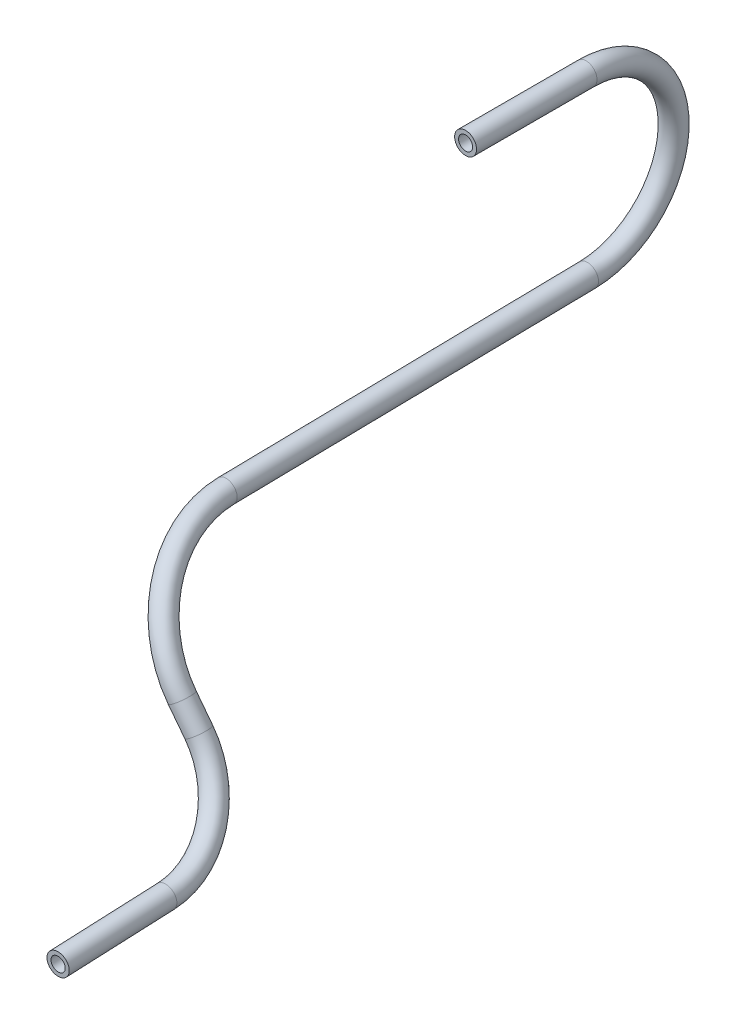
ISO-10303-21;
HEADER;
FILE_DESCRIPTION(('STEP AP214'),'2;1');
FILE_NAME('part.step','',(''),(''),'','','');
FILE_SCHEMA(('AUTOMOTIVE_DESIGN { 1 0 10303 214 1 1 1 1 }'));
ENDSEC;
DATA;
#1=APPLICATION_CONTEXT('core data for automotive mechanical design processes');
#2=APPLICATION_PROTOCOL_DEFINITION('international standard','automotive_design',2000,#1);
#3=PRODUCT_CONTEXT('',#1,'mechanical');
#4=PRODUCT('Part','Part','',(#3));
#5=PRODUCT_RELATED_PRODUCT_CATEGORY('part','',(#4));
#6=PRODUCT_DEFINITION_FORMATION('','',#4);
#7=PRODUCT_DEFINITION_CONTEXT('part definition',#1,'design');
#8=PRODUCT_DEFINITION('design','',#6,#7);
#9=PRODUCT_DEFINITION_SHAPE('','',#8);
#10=(LENGTH_UNIT() NAMED_UNIT(*) SI_UNIT(.MILLI.,.METRE.));
#11=(NAMED_UNIT(*) PLANE_ANGLE_UNIT() SI_UNIT($,.RADIAN.));
#12=(NAMED_UNIT(*) SI_UNIT($,.STERADIAN.) SOLID_ANGLE_UNIT());
#13=UNCERTAINTY_MEASURE_WITH_UNIT(LENGTH_MEASURE(1.E-05),#10,'distance_accuracy_value','');
#14=(GEOMETRIC_REPRESENTATION_CONTEXT(3) GLOBAL_UNCERTAINTY_ASSIGNED_CONTEXT((#13)) GLOBAL_UNIT_ASSIGNED_CONTEXT((#10,
#11,#12)) REPRESENTATION_CONTEXT('',''));
#15=CARTESIAN_POINT('',(0.,0.,0.));
#16=DIRECTION('',(0.,0.,1.));
#17=DIRECTION('',(1.,0.,0.));
#18=AXIS2_PLACEMENT_3D('',#15,#16,#17);
#19=CARTESIAN_POINT('',(0.,-25.3980657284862,-17.6841455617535));
#20=DIRECTION('',(0.,-0.0174524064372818,0.999847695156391));
#21=DIRECTION('',(0.,-0.999847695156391,-0.0174524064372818));
#22=AXIS2_PLACEMENT_3D('',#19,#20,#21);
#23=CYLINDRICAL_SURFACE('',#22,1.5875);
#24=CARTESIAN_POINT('',(0.,-25.3980657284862,-17.6841455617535));
#25=DIRECTION('',(0.,0.0174524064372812,-0.999847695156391));
#26=DIRECTION('',(1.,0.,0.));
#27=AXIS2_PLACEMENT_3D('',#24,#25,#26);
#28=CIRCLE('',#27,1.5875);
#29=CARTESIAN_POINT('',(0.,-26.985323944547,-17.7118512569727));
#30=VERTEX_POINT('',#29);
#31=EDGE_CURVE('E42',#30,#30,#28,.T.);
#32=ORIENTED_EDGE('',*,*,#31,.F.);
#33=EDGE_LOOP('',(#32));
#34=FACE_BOUND('',#33,.T.);
#35=CARTESIAN_POINT('',(0.,-26.3123536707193,34.6953755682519));
#36=DIRECTION('',(0.,0.0174524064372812,-0.999847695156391));
#37=DIRECTION('',(1.,0.,0.));
#38=AXIS2_PLACEMENT_3D('',#35,#36,#37);
#39=CIRCLE('',#38,1.5875);
#40=CARTESIAN_POINT('',(-0.91055259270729,-25.0121478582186,34.7180707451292));
#41=VERTEX_POINT('',#40);
#42=EDGE_CURVE('E10',#41,#41,#39,.T.);
#43=ORIENTED_EDGE('',*,*,#42,.T.);
#44=EDGE_LOOP('',(#43));
#45=FACE_BOUND('',#44,.T.);
#46=ADVANCED_FACE('F32',(#34,#45),#23,.T.);
#47=CARTESIAN_POINT('',(0.,-25.3980657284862,-17.6841455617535));
#48=DIRECTION('',(0.,-0.0174524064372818,0.999847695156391));
#49=DIRECTION('',(0.,-0.999847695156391,-0.0174524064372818));
#50=AXIS2_PLACEMENT_3D('',#47,#48,#49);
#51=CYLINDRICAL_SURFACE('',#50,1.016);
#52=CARTESIAN_POINT('',(0.,-25.3980657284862,-17.6841455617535));
#53=DIRECTION('',(0.,0.0174524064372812,-0.999847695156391));
#54=DIRECTION('',(1.,0.,0.));
#55=AXIS2_PLACEMENT_3D('',#52,#53,#54);
#56=CIRCLE('',#55,1.016);
#57=CARTESIAN_POINT('',(0.,-26.4139109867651,-17.7018772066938));
#58=VERTEX_POINT('',#57);
#59=EDGE_CURVE('E46',#58,#58,#56,.T.);
#60=ORIENTED_EDGE('',*,*,#59,.T.);
#61=EDGE_LOOP('',(#60));
#62=FACE_BOUND('',#61,.T.);
#63=CARTESIAN_POINT('',(0.,-26.3123536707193,34.6953755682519));
#64=DIRECTION('',(0.,0.0174524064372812,-0.999847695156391));
#65=DIRECTION('',(1.,0.,0.));
#66=AXIS2_PLACEMENT_3D('',#63,#64,#65);
#67=CIRCLE('',#66,1.016);
#68=CARTESIAN_POINT('',(-0.582753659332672,-25.4802219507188,34.7099004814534));
#69=VERTEX_POINT('',#68);
#70=EDGE_CURVE('E38',#69,#69,#67,.T.);
#71=ORIENTED_EDGE('',*,*,#70,.F.);
#72=EDGE_LOOP('',(#71));
#73=FACE_BOUND('',#72,.T.);
#74=ADVANCED_FACE('F108',(#62,#73),#51,.F.);
#75=CARTESIAN_POINT('',(0.,-12.7,-17.4625));
#76=DIRECTION('',(-1.,0.,0.));
#77=DIRECTION('',(0.,0.,1.));
#78=AXIS2_PLACEMENT_3D('',#75,#76,#77);
#79=TOROIDAL_SURFACE('',#78,12.7,1.5875);
#80=CARTESIAN_POINT('',(0.,0.,-17.4625));
#81=DIRECTION('',(0.,0.,1.));
#82=DIRECTION('',(1.,0.,0.));
#83=AXIS2_PLACEMENT_3D('',#80,#81,#82);
#84=CIRCLE('',#83,1.5875);
#85=CARTESIAN_POINT('',(0.,1.5875,-17.4625));
#86=VERTEX_POINT('',#85);
#87=EDGE_CURVE('E51',#86,#86,#84,.T.);
#88=CARTESIAN_POINT('',(0.,-12.7,-17.4625));
#89=DIRECTION('',(-1.,0.,0.));
#90=DIRECTION('',(0.,0.,1.));
#91=AXIS2_PLACEMENT_3D('',#88,#89,#90);
#92=CIRCLE('',#91,14.2875);
#93=EDGE_CURVE('',#86,#30,#92,.T.);
#94=ORIENTED_EDGE('',*,*,#87,.F.);
#95=ORIENTED_EDGE('',*,*,#31,.T.);
#96=ORIENTED_EDGE('',*,*,#93,.T.);
#97=ORIENTED_EDGE('',*,*,#93,.F.);
#98=EDGE_LOOP('',(#94,#96,#95,#97));
#99=FACE_BOUND('',#98,.T.);
#100=ADVANCED_FACE('F113',(#99),#79,.T.);
#101=CARTESIAN_POINT('',(0.,-12.7,-17.4625));
#102=DIRECTION('',(-1.,0.,0.));
#103=DIRECTION('',(0.,0.,1.));
#104=AXIS2_PLACEMENT_3D('',#101,#102,#103);
#105=TOROIDAL_SURFACE('',#104,12.7,1.016);
#106=CARTESIAN_POINT('',(0.,0.,-17.4625));
#107=DIRECTION('',(0.,0.,1.));
#108=DIRECTION('',(1.,0.,0.));
#109=AXIS2_PLACEMENT_3D('',#106,#107,#108);
#110=CIRCLE('',#109,1.016);
#111=CARTESIAN_POINT('',(0.,1.016,-17.4625));
#112=VERTEX_POINT('',#111);
#113=EDGE_CURVE('E55',#112,#112,#110,.T.);
#114=CARTESIAN_POINT('',(0.,-12.7,-17.4625));
#115=DIRECTION('',(-1.,0.,0.));
#116=DIRECTION('',(0.,0.,1.));
#117=AXIS2_PLACEMENT_3D('',#114,#115,#116);
#118=CIRCLE('',#117,13.716);
#119=EDGE_CURVE('',#112,#58,#118,.T.);
#120=ORIENTED_EDGE('',*,*,#113,.T.);
#121=ORIENTED_EDGE('',*,*,#59,.F.);
#122=ORIENTED_EDGE('',*,*,#119,.T.);
#123=ORIENTED_EDGE('',*,*,#119,.F.);
#124=EDGE_LOOP('',(#120,#122,#121,#123));
#125=FACE_BOUND('',#124,.T.);
#126=ADVANCED_FACE('F118',(#125),#105,.F.);
#127=CARTESIAN_POINT('',(0.,0.,-17.4625));
#128=DIRECTION('',(0.,0.,1.));
#129=DIRECTION('',(0.,-1.,0.));
#130=AXIS2_PLACEMENT_3D('',#127,#128,#129);
#131=CYLINDRICAL_SURFACE('',#130,1.016);
#132=ORIENTED_EDGE('',*,*,#113,.F.);
#133=EDGE_LOOP('',(#132));
#134=FACE_BOUND('',#133,.T.);
#135=CARTESIAN_POINT('',(0.,0.,0.));
#136=DIRECTION('',(0.,0.,1.));
#137=DIRECTION('',(1.,0.,0.));
#138=AXIS2_PLACEMENT_3D('',#135,#136,#137);
#139=CIRCLE('',#138,1.016);
#140=CARTESIAN_POINT('',(1.016,0.,0.));
#141=VERTEX_POINT('',#140);
#142=EDGE_CURVE('E56',#141,#141,#139,.T.);
#143=ORIENTED_EDGE('',*,*,#142,.T.);
#144=EDGE_LOOP('',(#143));
#145=FACE_BOUND('',#144,.T.);
#146=ADVANCED_FACE('F124',(#134,#145),#131,.F.);
#147=CARTESIAN_POINT('',(0.,0.,-17.4625));
#148=DIRECTION('',(0.,0.,1.));
#149=DIRECTION('',(0.,-1.,0.));
#150=AXIS2_PLACEMENT_3D('',#147,#148,#149);
#151=CYLINDRICAL_SURFACE('',#150,1.5875);
#152=ORIENTED_EDGE('',*,*,#87,.T.);
#153=EDGE_LOOP('',(#152));
#154=FACE_BOUND('',#153,.T.);
#155=CARTESIAN_POINT('',(0.,0.,0.));
#156=DIRECTION('',(0.,0.,1.));
#157=DIRECTION('',(1.,0.,0.));
#158=AXIS2_PLACEMENT_3D('',#155,#156,#157);
#159=CIRCLE('',#158,1.5875);
#160=CARTESIAN_POINT('',(1.5875,0.,0.));
#161=VERTEX_POINT('',#160);
#162=EDGE_CURVE('E52',#161,#161,#159,.T.);
#163=ORIENTED_EDGE('',*,*,#162,.F.);
#164=EDGE_LOOP('',(#163));
#165=FACE_BOUND('',#164,.T.);
#166=ADVANCED_FACE('F131',(#154,#165),#151,.T.);
#167=CARTESIAN_POINT('',(0.,0.,0.));
#168=DIRECTION('',(0.,0.,1.));
#169=DIRECTION('',(1.,0.,0.));
#170=AXIS2_PLACEMENT_3D('',#167,#168,#169);
#171=PLANE('',#170);
#172=ORIENTED_EDGE('',*,*,#142,.F.);
#173=EDGE_LOOP('',(#172));
#174=FACE_BOUND('',#173,.T.);
#175=ORIENTED_EDGE('',*,*,#162,.T.);
#176=EDGE_LOOP('',(#175));
#177=FACE_BOUND('',#176,.T.);
#178=ADVANCED_FACE('F135',(#174,#177),#171,.T.);
#179=CARTESIAN_POINT('',(9.10552592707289,-39.3144117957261,34.4684237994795));
#180=DIRECTION('',(-0.819152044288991,-0.573489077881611,-0.0100102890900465));
#181=DIRECTION('',(0.573517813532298,-0.819193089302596,0.));
#182=AXIS2_PLACEMENT_3D('',#179,#180,#181);
#183=TOROIDAL_SURFACE('',#182,15.875,1.01600000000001);
#184=CARTESIAN_POINT('',(9.26443926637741,-39.818343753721,50.3346276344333));
#185=DIRECTION('',(0.573489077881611,-0.818597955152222,-0.0317437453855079));
#186=DIRECTION('',(-0.478046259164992,-0.302936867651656,-0.824439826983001));
#187=AXIS2_PLACEMENT_3D('',#184,#185,#186);
#188=CIRCLE('',#187,1.01600000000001);
#189=CARTESIAN_POINT('',(9.2746097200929,-39.8505953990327,51.3500646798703));
#190=VERTEX_POINT('',#189);
#191=EDGE_CURVE('E66',#190,#190,#188,.T.);
#192=CARTESIAN_POINT('',(9.10552592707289,-39.3144117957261,34.4684237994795));
#193=DIRECTION('',(-0.819152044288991,-0.573489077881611,-0.0100102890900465));
#194=DIRECTION('',(0.573517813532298,-0.819193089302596,0.));
#195=AXIS2_PLACEMENT_3D('',#192,#193,#194);
#196=CIRCLE('',#195,16.891);
#197=EDGE_CURVE('',#190,#69,#196,.T.);
#198=ORIENTED_EDGE('',*,*,#191,.T.);
#199=ORIENTED_EDGE('',*,*,#70,.T.);
#200=ORIENTED_EDGE('',*,*,#197,.T.);
#201=ORIENTED_EDGE('',*,*,#197,.F.);
#202=EDGE_LOOP('',(#198,#200,#199,#201));
#203=FACE_BOUND('',#202,.T.);
#204=ADVANCED_FACE('F139',(#203),#183,.F.);
#205=CARTESIAN_POINT('',(9.10552592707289,-39.3144117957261,34.4684237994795));
#206=DIRECTION('',(-0.819152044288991,-0.573489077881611,-0.0100102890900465));
#207=DIRECTION('',(0.573517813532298,-0.819193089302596,0.));
#208=AXIS2_PLACEMENT_3D('',#205,#206,#207);
#209=TOROIDAL_SURFACE('',#208,15.875,1.5875);
#210=CARTESIAN_POINT('',(9.26443926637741,-39.818343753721,50.3346276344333));
#211=DIRECTION('',(0.573489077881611,-0.818597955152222,-0.0317437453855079));
#212=DIRECTION('',(-0.478046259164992,-0.302936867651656,-0.824439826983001));
#213=AXIS2_PLACEMENT_3D('',#210,#211,#212);
#214=CIRCLE('',#213,1.5875);
#215=CARTESIAN_POINT('',(9.28033060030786,-39.8687369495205,51.9212480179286));
#216=VERTEX_POINT('',#215);
#217=EDGE_CURVE('E59',#216,#216,#214,.T.);
#218=CARTESIAN_POINT('',(9.10552592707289,-39.3144117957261,34.4684237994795));
#219=DIRECTION('',(-0.819152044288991,-0.573489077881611,-0.0100102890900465));
#220=DIRECTION('',(0.573517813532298,-0.819193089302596,0.));
#221=AXIS2_PLACEMENT_3D('',#218,#219,#220);
#222=CIRCLE('',#221,17.4625);
#223=EDGE_CURVE('',#216,#41,#222,.T.);
#224=ORIENTED_EDGE('',*,*,#217,.F.);
#225=ORIENTED_EDGE('',*,*,#42,.F.);
#226=ORIENTED_EDGE('',*,*,#223,.T.);
#227=ORIENTED_EDGE('',*,*,#223,.F.);
#228=EDGE_LOOP('',(#224,#226,#225,#227));
#229=FACE_BOUND('',#228,.T.);
#230=ADVANCED_FACE('F141',(#229),#209,.T.);
#231=CARTESIAN_POINT('',(11.5404740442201,-43.0671543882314,50.2086446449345));
#232=DIRECTION('',(-0.573489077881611,0.818597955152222,0.0317437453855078));
#233=DIRECTION('',(-0.819010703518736,-0.57377823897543,0.));
#234=AXIS2_PLACEMENT_3D('',#231,#232,#233);
#235=CYLINDRICAL_SURFACE('',#234,1.58749999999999);
#236=CARTESIAN_POINT('',(11.5404740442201,-43.0671543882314,50.2086446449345));
#237=DIRECTION('',(0.573489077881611,-0.818597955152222,-0.0317437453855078));
#238=DIRECTION('',(0.819010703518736,0.57377823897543,0.));
#239=AXIS2_PLACEMENT_3D('',#236,#237,#238);
#240=CIRCLE('',#239,1.58749999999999);
#241=CARTESIAN_POINT('',(11.5137341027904,-43.0243584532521,48.6219469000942));
#242=VERTEX_POINT('',#241);
#243=EDGE_CURVE('E69',#242,#242,#240,.T.);
#244=ORIENTED_EDGE('',*,*,#243,.F.);
#245=EDGE_LOOP('',(#244));
#246=FACE_BOUND('',#245,.T.);
#247=ORIENTED_EDGE('',*,*,#217,.T.);
#248=EDGE_LOOP('',(#247));
#249=FACE_BOUND('',#248,.T.);
#250=ADVANCED_FACE('F144',(#246,#249),#235,.T.);
#251=CARTESIAN_POINT('',(11.5404740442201,-43.0671543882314,50.2086446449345));
#252=DIRECTION('',(-0.573489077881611,0.818597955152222,0.0317437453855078));
#253=DIRECTION('',(-0.819010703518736,-0.57377823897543,0.));
#254=AXIS2_PLACEMENT_3D('',#251,#252,#253);
#255=CYLINDRICAL_SURFACE('',#254,1.016);
#256=CARTESIAN_POINT('',(11.5404740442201,-43.0671543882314,50.2086446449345));
#257=DIRECTION('',(0.573489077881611,-0.818597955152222,-0.0317437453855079));
#258=DIRECTION('',(0.819010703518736,0.57377823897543,0.));
#259=AXIS2_PLACEMENT_3D('',#256,#257,#258);
#260=CIRCLE('',#259,1.01600000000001);
#261=CARTESIAN_POINT('',(11.5233604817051,-43.0397649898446,49.1931580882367));
#262=VERTEX_POINT('',#261);
#263=EDGE_CURVE('E75',#262,#262,#260,.T.);
#264=ORIENTED_EDGE('',*,*,#263,.T.);
#265=EDGE_LOOP('',(#264));
#266=FACE_BOUND('',#265,.T.);
#267=ORIENTED_EDGE('',*,*,#191,.F.);
#268=EDGE_LOOP('',(#267));
#269=FACE_BOUND('',#268,.T.);
#270=ADVANCED_FACE('F151',(#266,#269),#255,.F.);
#271=CARTESIAN_POINT('',(11.7543935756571,-43.4095218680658,62.9022266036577));
#272=DIRECTION('',(0.819040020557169,0.573733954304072,0.0016716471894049));
#273=DIRECTION('',(-0.573734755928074,0.819041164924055,0.));
#274=AXIS2_PLACEMENT_3D('',#271,#272,#273);
#275=TOROIDAL_SURFACE('',#274,12.7,1.01600000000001);
#276=CARTESIAN_POINT('',(19.0377048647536,-53.8057158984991,62.4990810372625));
#277=DIRECTION('',(0.0168440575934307,-0.0269580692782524,0.999494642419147));
#278=DIRECTION('',(0.,-0.999636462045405,-0.0269618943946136));
#279=AXIS2_PLACEMENT_3D('',#276,#277,#278);
#280=CIRCLE('',#279,1.01600000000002);
#281=CARTESIAN_POINT('',(19.6203697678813,-54.6374114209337,62.4668293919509));
#282=VERTEX_POINT('',#281);
#283=EDGE_CURVE('E82',#282,#282,#280,.T.);
#284=CARTESIAN_POINT('',(11.7543935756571,-43.4095218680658,62.9022266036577));
#285=DIRECTION('',(0.819040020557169,0.573733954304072,0.0016716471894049));
#286=DIRECTION('',(-0.573734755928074,0.819041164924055,0.));
#287=AXIS2_PLACEMENT_3D('',#284,#285,#286);
#288=CIRCLE('',#287,13.716);
#289=EDGE_CURVE('',#282,#262,#288,.T.);
#290=ORIENTED_EDGE('',*,*,#283,.T.);
#291=ORIENTED_EDGE('',*,*,#263,.F.);
#292=ORIENTED_EDGE('',*,*,#289,.T.);
#293=ORIENTED_EDGE('',*,*,#289,.F.);
#294=EDGE_LOOP('',(#290,#292,#291,#293));
#295=FACE_BOUND('',#294,.T.);
#296=ADVANCED_FACE('F103',(#295),#275,.F.);
#297=CARTESIAN_POINT('',(11.7543935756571,-43.4095218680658,62.9022266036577));
#298=DIRECTION('',(0.819040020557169,0.573733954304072,0.0016716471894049));
#299=DIRECTION('',(-0.573734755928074,0.819041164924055,0.));
#300=AXIS2_PLACEMENT_3D('',#297,#298,#299);
#301=TOROIDAL_SURFACE('',#300,12.7,1.58750000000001);
#302=CARTESIAN_POINT('',(19.0377048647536,-53.805715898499,62.4990810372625));
#303=DIRECTION('',(0.0168440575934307,-0.0269580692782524,0.999494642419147));
#304=DIRECTION('',(0.819998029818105,0.572364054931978,0.00161855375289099));
#305=AXIS2_PLACEMENT_3D('',#302,#303,#304);
#306=CIRCLE('',#305,1.58750000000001);
#307=CARTESIAN_POINT('',(19.9481187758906,-55.1052401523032,62.4486878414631));
#308=VERTEX_POINT('',#307);
#309=EDGE_CURVE('E72',#308,#308,#306,.T.);
#310=CARTESIAN_POINT('',(11.7543935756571,-43.4095218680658,62.9022266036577));
#311=DIRECTION('',(0.819040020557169,0.573733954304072,0.0016716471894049));
#312=DIRECTION('',(-0.573734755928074,0.819041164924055,0.));
#313=AXIS2_PLACEMENT_3D('',#310,#311,#312);
#314=CIRCLE('',#313,14.2875);
#315=EDGE_CURVE('',#308,#242,#314,.T.);
#316=ORIENTED_EDGE('',*,*,#309,.F.);
#317=ORIENTED_EDGE('',*,*,#243,.T.);
#318=ORIENTED_EDGE('',*,*,#315,.T.);
#319=ORIENTED_EDGE('',*,*,#315,.F.);
#320=EDGE_LOOP('',(#316,#318,#317,#319));
#321=FACE_BOUND('',#320,.T.);
#322=ADVANCED_FACE('F94',(#321),#301,.T.);
#323=CARTESIAN_POINT('',(19.3051042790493,-54.2336752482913,78.3660584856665));
#324=DIRECTION('',(0.0168440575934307,-0.0269580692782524,0.999494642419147));
#325=DIRECTION('',(0.,-0.999636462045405,-0.0269618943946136));
#326=AXIS2_PLACEMENT_3D('',#323,#324,#325);
#327=PLANE('',#326);
#328=CARTESIAN_POINT('',(19.3051042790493,-54.2336752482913,78.3660584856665));
#329=DIRECTION('',(0.0168440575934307,-0.0269580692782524,0.999494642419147));
#330=DIRECTION('',(0.,-0.999636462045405,-0.0269618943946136));
#331=AXIS2_PLACEMENT_3D('',#328,#329,#330);
#332=CIRCLE('',#331,1.5875);
#333=CARTESIAN_POINT('',(19.3051042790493,-55.8205981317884,78.323256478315));
#334=VERTEX_POINT('',#333);
#335=EDGE_CURVE('E78',#334,#334,#332,.T.);
#336=ORIENTED_EDGE('',*,*,#335,.T.);
#337=EDGE_LOOP('',(#336));
#338=FACE_BOUND('',#337,.T.);
#339=CARTESIAN_POINT('',(19.3051042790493,-54.2336752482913,78.3660584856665));
#340=DIRECTION('',(0.0168440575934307,-0.0269580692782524,0.999494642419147));
#341=DIRECTION('',(0.,-0.999636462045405,-0.0269618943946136));
#342=AXIS2_PLACEMENT_3D('',#339,#340,#341);
#343=CIRCLE('',#342,1.01600000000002);
#344=CARTESIAN_POINT('',(19.3051042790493,-55.2493058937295,78.3386652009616));
#345=VERTEX_POINT('',#344);
#346=EDGE_CURVE('E81',#345,#345,#343,.T.);
#347=ORIENTED_EDGE('',*,*,#346,.F.);
#348=EDGE_LOOP('',(#347));
#349=FACE_BOUND('',#348,.T.);
#350=ADVANCED_FACE('F91',(#338,#349),#327,.T.);
#351=CARTESIAN_POINT('',(19.3051042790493,-54.2336752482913,78.3660584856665));
#352=DIRECTION('',(-0.0168440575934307,0.0269580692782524,-0.999494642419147));
#353=DIRECTION('',(0.,0.999636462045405,0.0269618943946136));
#354=AXIS2_PLACEMENT_3D('',#351,#352,#353);
#355=CYLINDRICAL_SURFACE('',#354,1.5875);
#356=ORIENTED_EDGE('',*,*,#335,.F.);
#357=EDGE_LOOP('',(#356));
#358=FACE_BOUND('',#357,.T.);
#359=ORIENTED_EDGE('',*,*,#309,.T.);
#360=EDGE_LOOP('',(#359));
#361=FACE_BOUND('',#360,.T.);
#362=ADVANCED_FACE('F93',(#358,#361),#355,.T.);
#363=CARTESIAN_POINT('',(19.3051042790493,-54.2336752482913,78.3660584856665));
#364=DIRECTION('',(-0.0168440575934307,0.0269580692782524,-0.999494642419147));
#365=DIRECTION('',(0.,0.999636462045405,0.0269618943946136));
#366=AXIS2_PLACEMENT_3D('',#363,#364,#365);
#367=CYLINDRICAL_SURFACE('',#366,1.01600000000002);
#368=ORIENTED_EDGE('',*,*,#346,.T.);
#369=EDGE_LOOP('',(#368));
#370=FACE_BOUND('',#369,.T.);
#371=ORIENTED_EDGE('',*,*,#283,.F.);
#372=EDGE_LOOP('',(#371));
#373=FACE_BOUND('',#372,.T.);
#374=ADVANCED_FACE('F88',(#370,#373),#367,.F.);
#375=CLOSED_SHELL('',(#46,#74,#100,#126,#146,#166,#178,#204,#230,#250,#270,#296,#322,#350,#362,#374));
#376=MANIFOLD_SOLID_BREP('B2',#375);
#377=ADVANCED_BREP_SHAPE_REPRESENTATION('',(#18,#376),#14);
#378=SHAPE_DEFINITION_REPRESENTATION(#9,#377);
ENDSEC;
END-ISO-10303-21;
